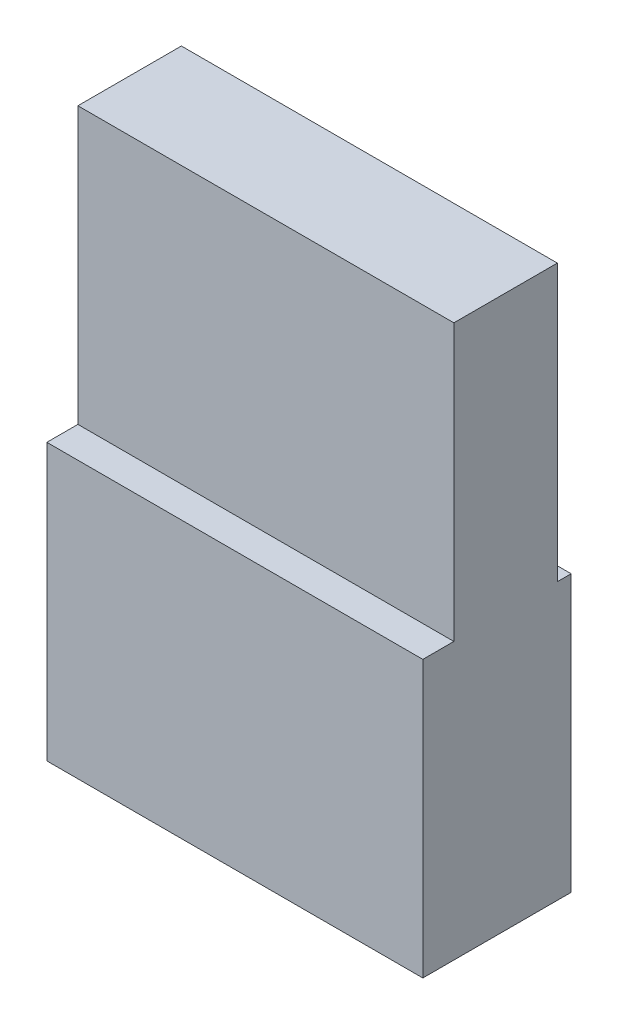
from build123d import *

# Parameters (mm, degrees)
SKETCH1_W           = 5.45
SKETCH1_H           = 2.15
BOSS_EXTRUDE1_DEPTH = 4
SKETCH2_W           = 5.45
SKETCH2_H           = 1.5
BOSS_EXTRUDE2_DEPTH = 4


with BuildPart() as part:
    # Sketch1 → Boss-Extrude1 (new body)
    with BuildSketch(Plane(origin=(0, 0, 0), x_dir=(1, 0, 0), z_dir=(0, 1, 0))):
        Rectangle(SKETCH1_W, SKETCH1_H)
    extrude(amount=BOSS_EXTRUDE1_DEPTH)

    # Sketch2 → Boss-Extrude2 (add)
    with BuildSketch(Plane(origin=(0, 4, 0), x_dir=(1, 0, 0), z_dir=(0, 1, 0))):
        with Locations((0, 0.125)):
            Rectangle(SKETCH2_W, SKETCH2_H)
    extrude(amount=BOSS_EXTRUDE2_DEPTH)


solid = part.part
